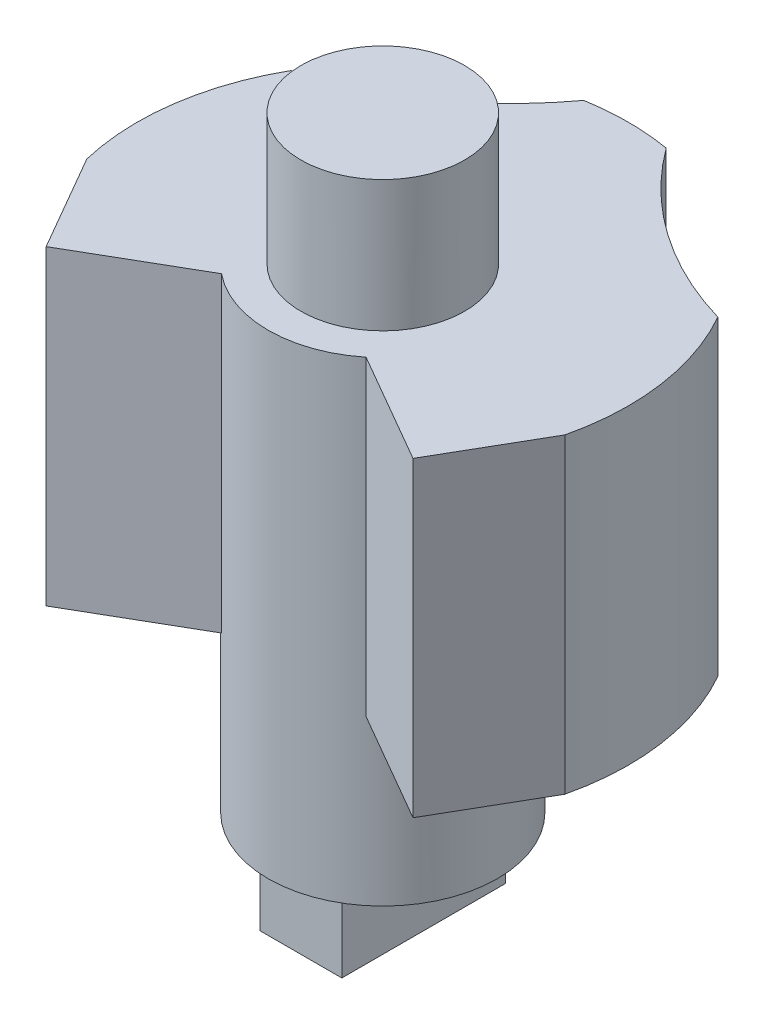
ISO-10303-21;
HEADER;
FILE_DESCRIPTION(('STEP AP214'),'2;1');
FILE_NAME('part.step','',(''),(''),'','','');
FILE_SCHEMA(('AUTOMOTIVE_DESIGN { 1 0 10303 214 1 1 1 1 }'));
ENDSEC;
DATA;
#1=APPLICATION_CONTEXT('core data for automotive mechanical design processes');
#2=APPLICATION_PROTOCOL_DEFINITION('international standard','automotive_design',2000,#1);
#3=PRODUCT_CONTEXT('',#1,'mechanical');
#4=PRODUCT('Part','Part','',(#3));
#5=PRODUCT_RELATED_PRODUCT_CATEGORY('part','',(#4));
#6=PRODUCT_DEFINITION_FORMATION('','',#4);
#7=PRODUCT_DEFINITION_CONTEXT('part definition',#1,'design');
#8=PRODUCT_DEFINITION('design','',#6,#7);
#9=PRODUCT_DEFINITION_SHAPE('','',#8);
#10=(LENGTH_UNIT() NAMED_UNIT(*) SI_UNIT(.MILLI.,.METRE.));
#11=(NAMED_UNIT(*) PLANE_ANGLE_UNIT() SI_UNIT($,.RADIAN.));
#12=(NAMED_UNIT(*) SI_UNIT($,.STERADIAN.) SOLID_ANGLE_UNIT());
#13=UNCERTAINTY_MEASURE_WITH_UNIT(LENGTH_MEASURE(1.E-05),#10,'distance_accuracy_value','');
#14=(GEOMETRIC_REPRESENTATION_CONTEXT(3) GLOBAL_UNCERTAINTY_ASSIGNED_CONTEXT((#13)) GLOBAL_UNIT_ASSIGNED_CONTEXT((#10,
#11,#12)) REPRESENTATION_CONTEXT('',''));
#15=CARTESIAN_POINT('',(0.,0.,0.));
#16=DIRECTION('',(0.,0.,1.));
#17=DIRECTION('',(1.,0.,0.));
#18=AXIS2_PLACEMENT_3D('',#15,#16,#17);
#19=CARTESIAN_POINT('',(0.,-6.35,0.));
#20=DIRECTION('',(0.,-1.,0.));
#21=DIRECTION('',(0.,0.,-1.));
#22=AXIS2_PLACEMENT_3D('',#19,#20,#21);
#23=PLANE('',#22);
#24=CARTESIAN_POINT('',(0.,-6.35,0.));
#25=DIRECTION('',(0.,-1.,0.));
#26=DIRECTION('',(0.,0.,-1.));
#27=AXIS2_PLACEMENT_3D('',#24,#25,#26);
#28=CIRCLE('',#27,4.445);
#29=CARTESIAN_POINT('',(0.,-6.35,-4.445));
#30=VERTEX_POINT('',#29);
#31=EDGE_CURVE('E163',#30,#30,#28,.T.);
#32=ORIENTED_EDGE('',*,*,#31,.T.);
#33=EDGE_LOOP('',(#32));
#34=FACE_BOUND('',#33,.T.);
#35=DIRECTION('',(-1.,0.,0.));
#36=VECTOR('',#35,1.);
#37=CARTESIAN_POINT('',(1.58750000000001,-6.35,-3.175));
#38=LINE('',#37,#36);
#39=CARTESIAN_POINT('',(1.58750000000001,-6.35,-3.175));
#40=VERTEX_POINT('',#39);
#41=CARTESIAN_POINT('',(-1.58749999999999,-6.35,-3.175));
#42=VERTEX_POINT('',#41);
#43=EDGE_CURVE('E44',#40,#42,#38,.T.);
#44=ORIENTED_EDGE('',*,*,#43,.T.);
#45=DIRECTION('',(0.,0.,-1.));
#46=VECTOR('',#45,1.);
#47=CARTESIAN_POINT('',(-1.58749999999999,-6.35,3.175));
#48=LINE('',#47,#46);
#49=CARTESIAN_POINT('',(-1.58749999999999,-6.35,3.175));
#50=VERTEX_POINT('',#49);
#51=EDGE_CURVE('E127',#50,#42,#48,.T.);
#52=ORIENTED_EDGE('',*,*,#51,.F.);
#53=DIRECTION('',(1.,0.,0.));
#54=VECTOR('',#53,1.);
#55=CARTESIAN_POINT('',(-1.58749999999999,-6.35,3.175));
#56=LINE('',#55,#54);
#57=CARTESIAN_POINT('',(1.58750000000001,-6.35,3.175));
#58=VERTEX_POINT('',#57);
#59=EDGE_CURVE('E130',#50,#58,#56,.T.);
#60=ORIENTED_EDGE('',*,*,#59,.T.);
#61=DIRECTION('',(0.,0.,1.));
#62=VECTOR('',#61,1.);
#63=CARTESIAN_POINT('',(1.58750000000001,-6.35,-3.175));
#64=LINE('',#63,#62);
#65=EDGE_CURVE('E49',#40,#58,#64,.T.);
#66=ORIENTED_EDGE('',*,*,#65,.F.);
#67=EDGE_LOOP('',(#44,#52,#60,#66));
#68=FACE_BOUND('',#67,.T.);
#69=ADVANCED_FACE('F27',(#34,#68),#23,.T.);
#70=CARTESIAN_POINT('',(0.,12.065,0.));
#71=DIRECTION('',(0.,-1.,0.));
#72=DIRECTION('',(0.,0.,-1.));
#73=AXIS2_PLACEMENT_3D('',#70,#71,#72);
#74=PLANE('',#73);
#75=CARTESIAN_POINT('',(0.,12.065,0.));
#76=DIRECTION('',(0.,-1.,0.));
#77=DIRECTION('',(0.,0.,-1.));
#78=AXIS2_PLACEMENT_3D('',#75,#76,#77);
#79=CIRCLE('',#78,9.525);
#80=CARTESIAN_POINT('',(-1.59967063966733,12.065,-9.38971132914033));
#81=VERTEX_POINT('',#80);
#82=CARTESIAN_POINT('',(1.59967063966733,12.065,-9.38971132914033));
#83=VERTEX_POINT('',#82);
#84=EDGE_CURVE('E215',#81,#83,#79,.T.);
#85=ORIENTED_EDGE('',*,*,#84,.F.);
#86=CARTESIAN_POINT('',(-11.8371837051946,12.065,-16.9052503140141));
#87=DIRECTION('',(0.,1.,0.));
#88=DIRECTION('',(0.,0.,-1.));
#89=AXIS2_PLACEMENT_3D('',#86,#87,#88);
#90=CIRCLE('',#89,12.7);
#91=CARTESIAN_POINT('',(-8.27632286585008,12.065,-4.71466911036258));
#92=VERTEX_POINT('',#91);
#93=EDGE_CURVE('E178',#92,#81,#90,.T.);
#94=ORIENTED_EDGE('',*,*,#93,.F.);
#95=CARTESIAN_POINT('',(0.,12.065,0.));
#96=DIRECTION('',(0.,1.,0.));
#97=DIRECTION('',(0.,0.,-1.));
#98=AXIS2_PLACEMENT_3D('',#95,#96,#97);
#99=CIRCLE('',#98,9.525);
#100=CARTESIAN_POINT('',(-9.26560709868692,12.065,2.20774774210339));
#101=VERTEX_POINT('',#100);
#102=EDGE_CURVE('E181',#92,#101,#99,.T.);
#103=ORIENTED_EDGE('',*,*,#102,.T.);
#104=DIRECTION('',(-0.499999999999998,0.,-0.866025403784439));
#105=VECTOR('',#104,1.);
#106=CARTESIAN_POINT('',(-7.11143813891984,12.065,5.93887782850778));
#107=LINE('',#106,#105);
#108=CARTESIAN_POINT('',(-7.11143813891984,12.065,5.93887782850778));
#109=VERTEX_POINT('',#108);
#110=EDGE_CURVE('E183',#109,#101,#107,.T.);
#111=ORIENTED_EDGE('',*,*,#110,.F.);
#112=DIRECTION('',(-0.86602540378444,0.,0.499999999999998));
#113=VECTOR('',#112,1.);
#114=CARTESIAN_POINT('',(-2.8018586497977,12.065,3.45074095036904));
#115=LINE('',#114,#113);
#116=CARTESIAN_POINT('',(-2.8018586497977,12.065,3.45074095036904));
#117=VERTEX_POINT('',#116);
#118=EDGE_CURVE('E186',#117,#109,#115,.T.);
#119=ORIENTED_EDGE('',*,*,#118,.F.);
#120=CARTESIAN_POINT('',(0.,12.065,0.));
#121=DIRECTION('',(0.,1.,0.));
#122=DIRECTION('',(0.,0.,1.));
#123=AXIS2_PLACEMENT_3D('',#120,#121,#122);
#124=CIRCLE('',#123,4.445);
#125=CARTESIAN_POINT('',(2.8018586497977,12.065,3.45074095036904));
#126=VERTEX_POINT('',#125);
#127=EDGE_CURVE('E227',#117,#126,#124,.T.);
#128=ORIENTED_EDGE('',*,*,#127,.T.);
#129=DIRECTION('',(0.86602540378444,0.,0.499999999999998));
#130=VECTOR('',#129,1.);
#131=CARTESIAN_POINT('',(2.8018586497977,12.065,3.45074095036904));
#132=LINE('',#131,#130);
#133=CARTESIAN_POINT('',(7.11143813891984,12.065,5.93887782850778));
#134=VERTEX_POINT('',#133);
#135=EDGE_CURVE('E225',#126,#134,#132,.T.);
#136=ORIENTED_EDGE('',*,*,#135,.T.);
#137=DIRECTION('',(0.499999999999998,0.,-0.866025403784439));
#138=VECTOR('',#137,1.);
#139=CARTESIAN_POINT('',(7.11143813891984,12.065,5.93887782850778));
#140=LINE('',#139,#138);
#141=CARTESIAN_POINT('',(9.26560709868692,12.065,2.20774774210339));
#142=VERTEX_POINT('',#141);
#143=EDGE_CURVE('E223',#134,#142,#140,.T.);
#144=ORIENTED_EDGE('',*,*,#143,.T.);
#145=CARTESIAN_POINT('',(0.,12.065,0.));
#146=DIRECTION('',(0.,-1.,0.));
#147=DIRECTION('',(0.,0.,-1.));
#148=AXIS2_PLACEMENT_3D('',#145,#146,#147);
#149=CIRCLE('',#148,9.525);
#150=CARTESIAN_POINT('',(8.27632286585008,12.065,-4.71466911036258));
#151=VERTEX_POINT('',#150);
#152=EDGE_CURVE('E220',#151,#142,#149,.T.);
#153=ORIENTED_EDGE('',*,*,#152,.F.);
#154=CARTESIAN_POINT('',(11.8371837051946,12.065,-16.9052503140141));
#155=DIRECTION('',(0.,-1.,0.));
#156=DIRECTION('',(0.,0.,-1.));
#157=AXIS2_PLACEMENT_3D('',#154,#155,#156);
#158=CIRCLE('',#157,12.7);
#159=EDGE_CURVE('E218',#151,#83,#158,.T.);
#160=ORIENTED_EDGE('',*,*,#159,.T.);
#161=EDGE_LOOP('',(#85,#94,#103,#111,#119,#128,#136,#144,#153,#160));
#162=FACE_BOUND('',#161,.T.);
#163=CARTESIAN_POINT('',(0.,12.065,0.));
#164=DIRECTION('',(0.,-1.,0.));
#165=DIRECTION('',(0.,0.,-1.));
#166=AXIS2_PLACEMENT_3D('',#163,#164,#165);
#167=CIRCLE('',#166,3.175);
#168=CARTESIAN_POINT('',(0.,12.065,-3.175));
#169=VERTEX_POINT('',#168);
#170=EDGE_CURVE('E36',#169,#169,#167,.F.);
#171=ORIENTED_EDGE('',*,*,#170,.F.);
#172=EDGE_LOOP('',(#171));
#173=FACE_BOUND('',#172,.T.);
#174=ADVANCED_FACE('F274',(#162,#173),#74,.F.);
#175=CARTESIAN_POINT('',(0.,12.065,0.));
#176=DIRECTION('',(0.,-1.,0.));
#177=DIRECTION('',(0.,0.,-1.));
#178=AXIS2_PLACEMENT_3D('',#175,#176,#177);
#179=CYLINDRICAL_SURFACE('',#178,9.525);
#180=CARTESIAN_POINT('',(0.,0.,0.));
#181=DIRECTION('',(0.,-1.,0.));
#182=DIRECTION('',(0.,0.,-1.));
#183=AXIS2_PLACEMENT_3D('',#180,#181,#182);
#184=CIRCLE('',#183,9.525);
#185=CARTESIAN_POINT('',(-1.59967063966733,0.,-9.38971132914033));
#186=VERTEX_POINT('',#185);
#187=CARTESIAN_POINT('',(1.59967063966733,0.,-9.38971132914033));
#188=VERTEX_POINT('',#187);
#189=EDGE_CURVE('E202',#186,#188,#184,.T.);
#190=ORIENTED_EDGE('',*,*,#189,.F.);
#191=DIRECTION('',(0.,-1.,0.));
#192=VECTOR('',#191,1.);
#193=CARTESIAN_POINT('',(-1.59967063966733,12.065,-9.38971132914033));
#194=LINE('',#193,#192);
#195=EDGE_CURVE('E189',#81,#186,#194,.T.);
#196=ORIENTED_EDGE('',*,*,#195,.F.);
#197=ORIENTED_EDGE('',*,*,#84,.T.);
#198=DIRECTION('',(0.,-1.,0.));
#199=VECTOR('',#198,1.);
#200=CARTESIAN_POINT('',(1.59967063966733,12.065,-9.38971132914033));
#201=LINE('',#200,#199);
#202=EDGE_CURVE('E229',#83,#188,#201,.T.);
#203=ORIENTED_EDGE('',*,*,#202,.T.);
#204=EDGE_LOOP('',(#190,#196,#197,#203));
#205=FACE_BOUND('',#204,.T.);
#206=ADVANCED_FACE('F29',(#205),#179,.T.);
#207=CARTESIAN_POINT('',(0.,12.065,0.));
#208=DIRECTION('',(0.,-1.,0.));
#209=DIRECTION('',(0.,0.,-1.));
#210=AXIS2_PLACEMENT_3D('',#207,#208,#209);
#211=CYLINDRICAL_SURFACE('',#210,4.445);
#212=DIRECTION('',(0.,-1.,0.));
#213=VECTOR('',#212,1.);
#214=CARTESIAN_POINT('',(-2.8018586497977,12.065,3.45074095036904));
#215=LINE('',#214,#213);
#216=CARTESIAN_POINT('',(-2.8018586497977,0.,3.45074095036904));
#217=VERTEX_POINT('',#216);
#218=EDGE_CURVE('E193',#117,#217,#215,.T.);
#219=ORIENTED_EDGE('',*,*,#218,.T.);
#220=CARTESIAN_POINT('',(0.,0.,0.));
#221=DIRECTION('',(0.,-1.,0.));
#222=DIRECTION('',(0.,0.,-1.));
#223=AXIS2_PLACEMENT_3D('',#220,#221,#222);
#224=CIRCLE('',#223,4.445);
#225=CARTESIAN_POINT('',(2.8018586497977,0.,3.45074095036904));
#226=VERTEX_POINT('',#225);
#227=EDGE_CURVE('E11',#217,#226,#224,.T.);
#228=ORIENTED_EDGE('',*,*,#227,.T.);
#229=DIRECTION('',(0.,-1.,0.));
#230=VECTOR('',#229,1.);
#231=CARTESIAN_POINT('',(2.8018586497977,12.065,3.45074095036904));
#232=LINE('',#231,#230);
#233=EDGE_CURVE('E233',#126,#226,#232,.T.);
#234=ORIENTED_EDGE('',*,*,#233,.F.);
#235=ORIENTED_EDGE('',*,*,#127,.F.);
#236=EDGE_LOOP('',(#219,#228,#234,#235));
#237=FACE_BOUND('',#236,.T.);
#238=ORIENTED_EDGE('',*,*,#31,.F.);
#239=EDGE_LOOP('',(#238));
#240=FACE_BOUND('',#239,.T.);
#241=ADVANCED_FACE('F254',(#237,#240),#211,.T.);
#242=CARTESIAN_POINT('',(2.8018586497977,12.065,3.45074095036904));
#243=DIRECTION('',(0.499999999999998,0.,-0.86602540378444));
#244=DIRECTION('',(-0.86602540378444,0.,-0.499999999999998));
#245=AXIS2_PLACEMENT_3D('',#242,#243,#244);
#246=PLANE('',#245);
#247=DIRECTION('',(0.86602540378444,0.,0.499999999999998));
#248=VECTOR('',#247,1.);
#249=CARTESIAN_POINT('',(2.8018586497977,0.,3.45074095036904));
#250=LINE('',#249,#248);
#251=CARTESIAN_POINT('',(7.11143813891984,0.,5.93887782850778));
#252=VERTEX_POINT('',#251);
#253=EDGE_CURVE('E214',#226,#252,#250,.T.);
#254=ORIENTED_EDGE('',*,*,#253,.T.);
#255=DIRECTION('',(0.,-1.,0.));
#256=VECTOR('',#255,1.);
#257=CARTESIAN_POINT('',(7.11143813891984,12.065,5.93887782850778));
#258=LINE('',#257,#256);
#259=EDGE_CURVE('E230',#134,#252,#258,.T.);
#260=ORIENTED_EDGE('',*,*,#259,.F.);
#261=ORIENTED_EDGE('',*,*,#135,.F.);
#262=ORIENTED_EDGE('',*,*,#233,.T.);
#263=EDGE_LOOP('',(#254,#260,#261,#262));
#264=FACE_BOUND('',#263,.T.);
#265=ADVANCED_FACE('F270',(#264),#246,.F.);
#266=CARTESIAN_POINT('',(7.11143813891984,12.065,5.93887782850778));
#267=DIRECTION('',(-0.86602540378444,0.,-0.499999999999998));
#268=DIRECTION('',(-0.499999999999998,0.,0.86602540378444));
#269=AXIS2_PLACEMENT_3D('',#266,#267,#268);
#270=PLANE('',#269);
#271=DIRECTION('',(0.499999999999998,0.,-0.866025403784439));
#272=VECTOR('',#271,1.);
#273=CARTESIAN_POINT('',(7.11143813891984,0.,5.93887782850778));
#274=LINE('',#273,#272);
#275=CARTESIAN_POINT('',(9.26560709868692,0.,2.20774774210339));
#276=VERTEX_POINT('',#275);
#277=EDGE_CURVE('E211',#252,#276,#274,.T.);
#278=ORIENTED_EDGE('',*,*,#277,.T.);
#279=DIRECTION('',(0.,-1.,0.));
#280=VECTOR('',#279,1.);
#281=CARTESIAN_POINT('',(9.26560709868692,12.065,2.20774774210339));
#282=LINE('',#281,#280);
#283=EDGE_CURVE('E234',#142,#276,#282,.T.);
#284=ORIENTED_EDGE('',*,*,#283,.F.);
#285=ORIENTED_EDGE('',*,*,#143,.F.);
#286=ORIENTED_EDGE('',*,*,#259,.T.);
#287=EDGE_LOOP('',(#278,#284,#285,#286));
#288=FACE_BOUND('',#287,.T.);
#289=ADVANCED_FACE('F298',(#288),#270,.F.);
#290=CARTESIAN_POINT('',(0.,12.065,0.));
#291=DIRECTION('',(0.,-1.,0.));
#292=DIRECTION('',(0.,0.,-1.));
#293=AXIS2_PLACEMENT_3D('',#290,#291,#292);
#294=CYLINDRICAL_SURFACE('',#293,9.525);
#295=CARTESIAN_POINT('',(0.,0.,0.));
#296=DIRECTION('',(0.,-1.,0.));
#297=DIRECTION('',(0.,0.,-1.));
#298=AXIS2_PLACEMENT_3D('',#295,#296,#297);
#299=CIRCLE('',#298,9.525);
#300=CARTESIAN_POINT('',(8.27632286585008,0.,-4.71466911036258));
#301=VERTEX_POINT('',#300);
#302=EDGE_CURVE('E208',#301,#276,#299,.T.);
#303=ORIENTED_EDGE('',*,*,#302,.F.);
#304=DIRECTION('',(0.,-1.,0.));
#305=VECTOR('',#304,1.);
#306=CARTESIAN_POINT('',(8.27632286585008,12.065,-4.71466911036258));
#307=LINE('',#306,#305);
#308=EDGE_CURVE('E236',#151,#301,#307,.T.);
#309=ORIENTED_EDGE('',*,*,#308,.F.);
#310=ORIENTED_EDGE('',*,*,#152,.T.);
#311=ORIENTED_EDGE('',*,*,#283,.T.);
#312=EDGE_LOOP('',(#303,#309,#310,#311));
#313=FACE_BOUND('',#312,.T.);
#314=ADVANCED_FACE('F296',(#313),#294,.T.);
#315=CARTESIAN_POINT('',(11.8371837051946,12.065,-16.9052503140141));
#316=DIRECTION('',(0.,-1.,0.));
#317=DIRECTION('',(0.,0.,-1.));
#318=AXIS2_PLACEMENT_3D('',#315,#316,#317);
#319=CYLINDRICAL_SURFACE('',#318,12.7);
#320=CARTESIAN_POINT('',(11.8371837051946,0.,-16.9052503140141));
#321=DIRECTION('',(0.,-1.,0.));
#322=DIRECTION('',(0.,0.,-1.));
#323=AXIS2_PLACEMENT_3D('',#320,#321,#322);
#324=CIRCLE('',#323,12.7);
#325=EDGE_CURVE('E205',#301,#188,#324,.T.);
#326=ORIENTED_EDGE('',*,*,#325,.T.);
#327=ORIENTED_EDGE('',*,*,#202,.F.);
#328=ORIENTED_EDGE('',*,*,#159,.F.);
#329=ORIENTED_EDGE('',*,*,#308,.T.);
#330=EDGE_LOOP('',(#326,#327,#328,#329));
#331=FACE_BOUND('',#330,.T.);
#332=ADVANCED_FACE('F293',(#331),#319,.F.);
#333=CARTESIAN_POINT('',(0.,0.,0.));
#334=DIRECTION('',(0.,-1.,0.));
#335=DIRECTION('',(0.,0.,-1.));
#336=AXIS2_PLACEMENT_3D('',#333,#334,#335);
#337=PLANE('',#336);
#338=ORIENTED_EDGE('',*,*,#227,.F.);
#339=DIRECTION('',(-0.86602540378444,0.,0.499999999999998));
#340=VECTOR('',#339,1.);
#341=CARTESIAN_POINT('',(-2.8018586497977,0.,3.45074095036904));
#342=LINE('',#341,#340);
#343=CARTESIAN_POINT('',(-7.11143813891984,0.,5.93887782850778));
#344=VERTEX_POINT('',#343);
#345=EDGE_CURVE('E177',#217,#344,#342,.T.);
#346=ORIENTED_EDGE('',*,*,#345,.T.);
#347=DIRECTION('',(-0.499999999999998,0.,-0.866025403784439));
#348=VECTOR('',#347,1.);
#349=CARTESIAN_POINT('',(-7.11143813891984,0.,5.93887782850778));
#350=LINE('',#349,#348);
#351=CARTESIAN_POINT('',(-9.26560709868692,0.,2.20774774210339));
#352=VERTEX_POINT('',#351);
#353=EDGE_CURVE('E174',#344,#352,#350,.T.);
#354=ORIENTED_EDGE('',*,*,#353,.T.);
#355=CARTESIAN_POINT('',(0.,0.,0.));
#356=DIRECTION('',(0.,1.,0.));
#357=DIRECTION('',(0.,0.,-1.));
#358=AXIS2_PLACEMENT_3D('',#355,#356,#357);
#359=CIRCLE('',#358,9.525);
#360=CARTESIAN_POINT('',(-8.27632286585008,0.,-4.71466911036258));
#361=VERTEX_POINT('',#360);
#362=EDGE_CURVE('E172',#361,#352,#359,.T.);
#363=ORIENTED_EDGE('',*,*,#362,.F.);
#364=CARTESIAN_POINT('',(-11.8371837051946,0.,-16.9052503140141));
#365=DIRECTION('',(0.,1.,0.));
#366=DIRECTION('',(0.,0.,-1.));
#367=AXIS2_PLACEMENT_3D('',#364,#365,#366);
#368=CIRCLE('',#367,12.7);
#369=EDGE_CURVE('E169',#361,#186,#368,.T.);
#370=ORIENTED_EDGE('',*,*,#369,.T.);
#371=ORIENTED_EDGE('',*,*,#189,.T.);
#372=ORIENTED_EDGE('',*,*,#325,.F.);
#373=ORIENTED_EDGE('',*,*,#302,.T.);
#374=ORIENTED_EDGE('',*,*,#277,.F.);
#375=ORIENTED_EDGE('',*,*,#253,.F.);
#376=EDGE_LOOP('',(#338,#346,#354,#363,#370,#371,#372,#373,#374,#375));
#377=FACE_BOUND('',#376,.T.);
#378=ADVANCED_FACE('F263',(#377),#337,.T.);
#379=CARTESIAN_POINT('',(-2.8018586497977,12.065,3.45074095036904));
#380=DIRECTION('',(-0.499999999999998,0.,-0.86602540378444));
#381=DIRECTION('',(0.86602540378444,0.,-0.499999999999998));
#382=AXIS2_PLACEMENT_3D('',#379,#380,#381);
#383=PLANE('',#382);
#384=ORIENTED_EDGE('',*,*,#345,.F.);
#385=ORIENTED_EDGE('',*,*,#218,.F.);
#386=ORIENTED_EDGE('',*,*,#118,.T.);
#387=DIRECTION('',(0.,-1.,0.));
#388=VECTOR('',#387,1.);
#389=CARTESIAN_POINT('',(-7.11143813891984,12.065,5.93887782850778));
#390=LINE('',#389,#388);
#391=EDGE_CURVE('E190',#109,#344,#390,.T.);
#392=ORIENTED_EDGE('',*,*,#391,.T.);
#393=EDGE_LOOP('',(#384,#385,#386,#392));
#394=FACE_BOUND('',#393,.T.);
#395=ADVANCED_FACE('F260',(#394),#383,.F.);
#396=CARTESIAN_POINT('',(-7.11143813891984,12.065,5.93887782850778));
#397=DIRECTION('',(0.86602540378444,0.,-0.499999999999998));
#398=DIRECTION('',(0.499999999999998,0.,0.86602540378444));
#399=AXIS2_PLACEMENT_3D('',#396,#397,#398);
#400=PLANE('',#399);
#401=ORIENTED_EDGE('',*,*,#353,.F.);
#402=ORIENTED_EDGE('',*,*,#391,.F.);
#403=ORIENTED_EDGE('',*,*,#110,.T.);
#404=DIRECTION('',(0.,-1.,0.));
#405=VECTOR('',#404,1.);
#406=CARTESIAN_POINT('',(-9.26560709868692,12.065,2.20774774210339));
#407=LINE('',#406,#405);
#408=EDGE_CURVE('E194',#101,#352,#407,.T.);
#409=ORIENTED_EDGE('',*,*,#408,.T.);
#410=EDGE_LOOP('',(#401,#402,#403,#409));
#411=FACE_BOUND('',#410,.T.);
#412=ADVANCED_FACE('F281',(#411),#400,.F.);
#413=CARTESIAN_POINT('',(0.,12.065,0.));
#414=DIRECTION('',(0.,-1.,0.));
#415=DIRECTION('',(0.,0.,-1.));
#416=AXIS2_PLACEMENT_3D('',#413,#414,#415);
#417=CYLINDRICAL_SURFACE('',#416,9.525);
#418=ORIENTED_EDGE('',*,*,#362,.T.);
#419=ORIENTED_EDGE('',*,*,#408,.F.);
#420=ORIENTED_EDGE('',*,*,#102,.F.);
#421=DIRECTION('',(0.,-1.,0.));
#422=VECTOR('',#421,1.);
#423=CARTESIAN_POINT('',(-8.27632286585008,12.065,-4.71466911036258));
#424=LINE('',#423,#422);
#425=EDGE_CURVE('E197',#92,#361,#424,.T.);
#426=ORIENTED_EDGE('',*,*,#425,.T.);
#427=EDGE_LOOP('',(#418,#419,#420,#426));
#428=FACE_BOUND('',#427,.T.);
#429=ADVANCED_FACE('F283',(#428),#417,.T.);
#430=CARTESIAN_POINT('',(-11.8371837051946,12.065,-16.9052503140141));
#431=DIRECTION('',(0.,-1.,0.));
#432=DIRECTION('',(0.,0.,-1.));
#433=AXIS2_PLACEMENT_3D('',#430,#431,#432);
#434=CYLINDRICAL_SURFACE('',#433,12.7);
#435=ORIENTED_EDGE('',*,*,#369,.F.);
#436=ORIENTED_EDGE('',*,*,#425,.F.);
#437=ORIENTED_EDGE('',*,*,#93,.T.);
#438=ORIENTED_EDGE('',*,*,#195,.T.);
#439=EDGE_LOOP('',(#435,#436,#437,#438));
#440=FACE_BOUND('',#439,.T.);
#441=ADVANCED_FACE('F288',(#440),#434,.F.);
#442=CARTESIAN_POINT('',(0.,17.145,0.));
#443=DIRECTION('',(0.,-1.,0.));
#444=DIRECTION('',(0.,0.,-1.));
#445=AXIS2_PLACEMENT_3D('',#442,#443,#444);
#446=CYLINDRICAL_SURFACE('',#445,3.175);
#447=CARTESIAN_POINT('',(0.,17.145,0.));
#448=DIRECTION('',(0.,1.,0.));
#449=DIRECTION('',(0.,0.,1.));
#450=AXIS2_PLACEMENT_3D('',#447,#448,#449);
#451=CIRCLE('',#450,3.175);
#452=CARTESIAN_POINT('',(0.,17.145,3.175));
#453=VERTEX_POINT('',#452);
#454=EDGE_CURVE('E166',#453,#453,#451,.T.);
#455=ORIENTED_EDGE('',*,*,#454,.F.);
#456=EDGE_LOOP('',(#455));
#457=FACE_BOUND('',#456,.T.);
#458=ORIENTED_EDGE('',*,*,#170,.T.);
#459=EDGE_LOOP('',(#458));
#460=FACE_BOUND('',#459,.T.);
#461=ADVANCED_FACE('F324',(#457,#460),#446,.T.);
#462=CARTESIAN_POINT('',(0.,17.145,0.));
#463=DIRECTION('',(0.,1.,0.));
#464=DIRECTION('',(0.,0.,1.));
#465=AXIS2_PLACEMENT_3D('',#462,#463,#464);
#466=PLANE('',#465);
#467=ORIENTED_EDGE('',*,*,#454,.T.);
#468=EDGE_LOOP('',(#467));
#469=FACE_BOUND('',#468,.T.);
#470=ADVANCED_FACE('F321',(#469),#466,.T.);
#471=CARTESIAN_POINT('',(-1.58749999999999,-9.525,3.175));
#472=DIRECTION('',(1.,0.,0.));
#473=DIRECTION('',(0.,0.,-1.));
#474=AXIS2_PLACEMENT_3D('',#471,#472,#473);
#475=PLANE('',#474);
#476=ORIENTED_EDGE('',*,*,#51,.T.);
#477=DIRECTION('',(0.,1.,0.));
#478=VECTOR('',#477,1.);
#479=CARTESIAN_POINT('',(-1.58749999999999,-9.525,-3.175));
#480=LINE('',#479,#478);
#481=CARTESIAN_POINT('',(-1.58749999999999,-9.525,-3.175));
#482=VERTEX_POINT('',#481);
#483=EDGE_CURVE('E161',#482,#42,#480,.T.);
#484=ORIENTED_EDGE('',*,*,#483,.F.);
#485=DIRECTION('',(0.,0.,-1.));
#486=VECTOR('',#485,1.);
#487=CARTESIAN_POINT('',(-1.58749999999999,-9.525,3.175));
#488=LINE('',#487,#486);
#489=CARTESIAN_POINT('',(-1.58749999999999,-9.525,3.175));
#490=VERTEX_POINT('',#489);
#491=EDGE_CURVE('E138',#490,#482,#488,.T.);
#492=ORIENTED_EDGE('',*,*,#491,.F.);
#493=DIRECTION('',(0.,1.,0.));
#494=VECTOR('',#493,1.);
#495=CARTESIAN_POINT('',(-1.58749999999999,-9.525,3.175));
#496=LINE('',#495,#494);
#497=EDGE_CURVE('E136',#490,#50,#496,.T.);
#498=ORIENTED_EDGE('',*,*,#497,.T.);
#499=EDGE_LOOP('',(#476,#484,#492,#498));
#500=FACE_BOUND('',#499,.T.);
#501=ADVANCED_FACE('F137',(#500),#475,.F.);
#502=CARTESIAN_POINT('',(1.58750000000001,-9.525,-3.175));
#503=DIRECTION('',(0.,0.,-1.));
#504=DIRECTION('',(-1.,0.,0.));
#505=AXIS2_PLACEMENT_3D('',#502,#503,#504);
#506=PLANE('',#505);
#507=ORIENTED_EDGE('',*,*,#43,.F.);
#508=DIRECTION('',(0.,1.,0.));
#509=VECTOR('',#508,1.);
#510=CARTESIAN_POINT('',(1.58750000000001,-9.525,-3.175));
#511=LINE('',#510,#509);
#512=CARTESIAN_POINT('',(1.58750000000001,-9.525,-3.175));
#513=VERTEX_POINT('',#512);
#514=EDGE_CURVE('E159',#513,#40,#511,.T.);
#515=ORIENTED_EDGE('',*,*,#514,.F.);
#516=DIRECTION('',(-1.,0.,0.));
#517=VECTOR('',#516,1.);
#518=CARTESIAN_POINT('',(1.58750000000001,-9.525,-3.175));
#519=LINE('',#518,#517);
#520=EDGE_CURVE('E148',#513,#482,#519,.T.);
#521=ORIENTED_EDGE('',*,*,#520,.T.);
#522=ORIENTED_EDGE('',*,*,#483,.T.);
#523=EDGE_LOOP('',(#507,#515,#521,#522));
#524=FACE_BOUND('',#523,.T.);
#525=ADVANCED_FACE('F388',(#524),#506,.T.);
#526=CARTESIAN_POINT('',(1.58750000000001,-9.525,-3.175));
#527=DIRECTION('',(-1.,0.,0.));
#528=DIRECTION('',(0.,0.,1.));
#529=AXIS2_PLACEMENT_3D('',#526,#527,#528);
#530=PLANE('',#529);
#531=ORIENTED_EDGE('',*,*,#65,.T.);
#532=DIRECTION('',(0.,1.,0.));
#533=VECTOR('',#532,1.);
#534=CARTESIAN_POINT('',(1.58750000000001,-9.525,3.175));
#535=LINE('',#534,#533);
#536=CARTESIAN_POINT('',(1.58750000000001,-9.525,3.175));
#537=VERTEX_POINT('',#536);
#538=EDGE_CURVE('E142',#537,#58,#535,.T.);
#539=ORIENTED_EDGE('',*,*,#538,.F.);
#540=DIRECTION('',(0.,0.,1.));
#541=VECTOR('',#540,1.);
#542=CARTESIAN_POINT('',(1.58750000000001,-9.525,-3.175));
#543=LINE('',#542,#541);
#544=EDGE_CURVE('E155',#513,#537,#543,.T.);
#545=ORIENTED_EDGE('',*,*,#544,.F.);
#546=ORIENTED_EDGE('',*,*,#514,.T.);
#547=EDGE_LOOP('',(#531,#539,#545,#546));
#548=FACE_BOUND('',#547,.T.);
#549=ADVANCED_FACE('F394',(#548),#530,.F.);
#550=CARTESIAN_POINT('',(-1.58749999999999,-9.525,3.175));
#551=DIRECTION('',(0.,0.,1.));
#552=DIRECTION('',(1.,0.,0.));
#553=AXIS2_PLACEMENT_3D('',#550,#551,#552);
#554=PLANE('',#553);
#555=ORIENTED_EDGE('',*,*,#59,.F.);
#556=ORIENTED_EDGE('',*,*,#497,.F.);
#557=DIRECTION('',(1.,0.,0.));
#558=VECTOR('',#557,1.);
#559=CARTESIAN_POINT('',(-1.58749999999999,-9.525,3.175));
#560=LINE('',#559,#558);
#561=EDGE_CURVE('E143',#490,#537,#560,.T.);
#562=ORIENTED_EDGE('',*,*,#561,.T.);
#563=ORIENTED_EDGE('',*,*,#538,.T.);
#564=EDGE_LOOP('',(#555,#556,#562,#563));
#565=FACE_BOUND('',#564,.T.);
#566=ADVANCED_FACE('F145',(#565),#554,.T.);
#567=CARTESIAN_POINT('',(-1.58749999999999,-9.525,-3.175));
#568=DIRECTION('',(0.,1.,0.));
#569=DIRECTION('',(0.,0.,1.));
#570=AXIS2_PLACEMENT_3D('',#567,#568,#569);
#571=PLANE('',#570);
#572=ORIENTED_EDGE('',*,*,#491,.T.);
#573=ORIENTED_EDGE('',*,*,#520,.F.);
#574=ORIENTED_EDGE('',*,*,#544,.T.);
#575=ORIENTED_EDGE('',*,*,#561,.F.);
#576=EDGE_LOOP('',(#572,#573,#574,#575));
#577=FACE_BOUND('',#576,.T.);
#578=ADVANCED_FACE('F408',(#577),#571,.F.);
#579=CLOSED_SHELL('',(#69,#174,#206,#241,#265,#289,#314,#332,#378,#395,#412,#429,#441,#461,#470,
#501,#525,#549,#566,#578));
#580=MANIFOLD_SOLID_BREP('B2',#579);
#581=ADVANCED_BREP_SHAPE_REPRESENTATION('',(#18,#580),#14);
#582=SHAPE_DEFINITION_REPRESENTATION(#9,#581);
ENDSEC;
END-ISO-10303-21;
